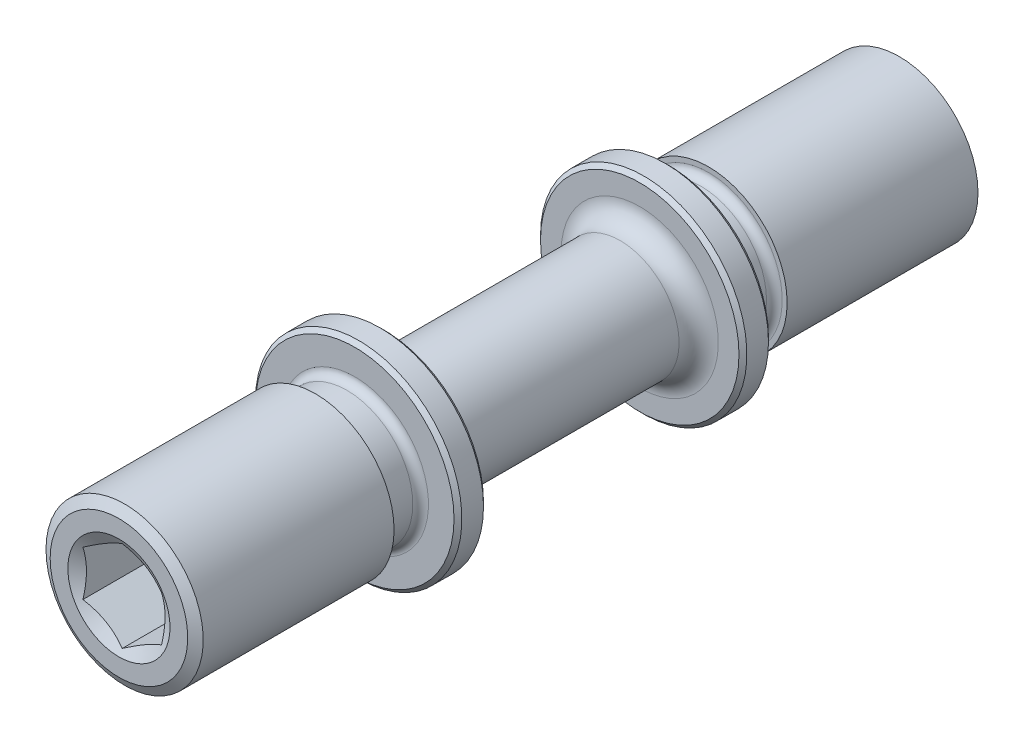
ISO-10303-21;
HEADER;
FILE_DESCRIPTION(('STEP AP214'),'2;1');
FILE_NAME('part.step','',(''),(''),'','','');
FILE_SCHEMA(('AUTOMOTIVE_DESIGN { 1 0 10303 214 1 1 1 1 }'));
ENDSEC;
DATA;
#1=APPLICATION_CONTEXT('core data for automotive mechanical design processes');
#2=APPLICATION_PROTOCOL_DEFINITION('international standard','automotive_design',2000,#1);
#3=PRODUCT_CONTEXT('',#1,'mechanical');
#4=PRODUCT('Part','Part','',(#3));
#5=PRODUCT_RELATED_PRODUCT_CATEGORY('part','',(#4));
#6=PRODUCT_DEFINITION_FORMATION('','',#4);
#7=PRODUCT_DEFINITION_CONTEXT('part definition',#1,'design');
#8=PRODUCT_DEFINITION('design','',#6,#7);
#9=PRODUCT_DEFINITION_SHAPE('','',#8);
#10=(LENGTH_UNIT() NAMED_UNIT(*) SI_UNIT(.MILLI.,.METRE.));
#11=(NAMED_UNIT(*) PLANE_ANGLE_UNIT() SI_UNIT($,.RADIAN.));
#12=(NAMED_UNIT(*) SI_UNIT($,.STERADIAN.) SOLID_ANGLE_UNIT());
#13=UNCERTAINTY_MEASURE_WITH_UNIT(LENGTH_MEASURE(1.E-05),#10,'distance_accuracy_value','');
#14=(GEOMETRIC_REPRESENTATION_CONTEXT(3) GLOBAL_UNCERTAINTY_ASSIGNED_CONTEXT((#13)) GLOBAL_UNIT_ASSIGNED_CONTEXT((#10,
#11,#12)) REPRESENTATION_CONTEXT('',''));
#15=CARTESIAN_POINT('',(0.,0.,0.));
#16=DIRECTION('',(0.,0.,1.));
#17=DIRECTION('',(1.,0.,0.));
#18=AXIS2_PLACEMENT_3D('',#15,#16,#17);
#19=CARTESIAN_POINT('',(0.,3.00000000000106,6.49999999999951));
#20=DIRECTION('',(0.,1.63071571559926E-13,1.));
#21=DIRECTION('',(1.,0.,0.));
#22=AXIS2_PLACEMENT_3D('',#19,#20,#21);
#23=PLANE('',#22);
#24=CARTESIAN_POINT('',(0.,1.05996521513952E-12,6.5));
#25=DIRECTION('',(0.,1.63071571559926E-13,1.));
#26=DIRECTION('',(1.,0.,0.));
#27=AXIS2_PLACEMENT_3D('',#24,#25,#26);
#28=CIRCLE('',#27,5.05);
#29=CARTESIAN_POINT('',(5.05,1.05996521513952E-12,6.5));
#30=VERTEX_POINT('',#29);
#31=EDGE_CURVE('E9',#30,#30,#28,.F.);
#32=ORIENTED_EDGE('',*,*,#31,.T.);
#33=EDGE_LOOP('',(#32));
#34=FACE_BOUND('',#33,.T.);
#35=CARTESIAN_POINT('',(0.,1.05996521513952E-12,6.5));
#36=DIRECTION('',(0.,1.63071571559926E-13,1.));
#37=DIRECTION('',(1.,0.,0.));
#38=AXIS2_PLACEMENT_3D('',#35,#36,#37);
#39=CIRCLE('',#38,4.);
#40=CARTESIAN_POINT('',(4.,1.05996521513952E-12,6.5));
#41=VERTEX_POINT('',#40);
#42=EDGE_CURVE('E138',#41,#41,#39,.T.);
#43=ORIENTED_EDGE('',*,*,#42,.T.);
#44=EDGE_LOOP('',(#43));
#45=FACE_BOUND('',#44,.T.);
#46=ADVANCED_FACE('F14',(#34,#45),#23,.F.);
#47=CARTESIAN_POINT('',(0.,3.26143143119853E-12,20.));
#48=DIRECTION('',(0.,-1.63071571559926E-13,-1.));
#49=DIRECTION('',(-1.,0.,0.));
#50=AXIS2_PLACEMENT_3D('',#47,#48,#49);
#51=CYLINDRICAL_SURFACE('',#50,3.);
#52=CARTESIAN_POINT('',(0.,8.96893643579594E-13,5.5));
#53=DIRECTION('',(0.,1.63071571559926E-13,1.));
#54=DIRECTION('',(1.,0.,0.));
#55=AXIS2_PLACEMENT_3D('',#52,#53,#54);
#56=CIRCLE('',#55,3.);
#57=CARTESIAN_POINT('',(3.,8.96893643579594E-13,5.5));
#58=VERTEX_POINT('',#57);
#59=EDGE_CURVE('E135',#58,#58,#56,.F.);
#60=ORIENTED_EDGE('',*,*,#59,.T.);
#61=EDGE_LOOP('',(#60));
#62=FACE_BOUND('',#61,.T.);
#63=CARTESIAN_POINT('',(0.,-8.96893643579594E-13,-5.5));
#64=DIRECTION('',(0.,-1.63071571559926E-13,-1.));
#65=DIRECTION('',(-1.,0.,0.));
#66=AXIS2_PLACEMENT_3D('',#63,#64,#65);
#67=CIRCLE('',#66,3.);
#68=CARTESIAN_POINT('',(-3.,-8.96893643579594E-13,-5.5));
#69=VERTEX_POINT('',#68);
#70=EDGE_CURVE('E132',#69,#69,#67,.F.);
#71=ORIENTED_EDGE('',*,*,#70,.T.);
#72=EDGE_LOOP('',(#71));
#73=FACE_BOUND('',#72,.T.);
#74=ADVANCED_FACE('F186',(#62,#73),#51,.T.);
#75=CARTESIAN_POINT('',(0.,3.99999999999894,-6.50000000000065));
#76=DIRECTION('',(0.,-1.63071571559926E-13,-1.));
#77=DIRECTION('',(-1.,0.,0.));
#78=AXIS2_PLACEMENT_3D('',#75,#76,#77);
#79=PLANE('',#78);
#80=CARTESIAN_POINT('',(0.,-1.05996521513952E-12,-6.5));
#81=DIRECTION('',(0.,-1.63071571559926E-13,-1.));
#82=DIRECTION('',(-1.,0.,0.));
#83=AXIS2_PLACEMENT_3D('',#80,#81,#82);
#84=CIRCLE('',#83,5.05);
#85=CARTESIAN_POINT('',(-5.05,-1.05996521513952E-12,-6.5));
#86=VERTEX_POINT('',#85);
#87=EDGE_CURVE('E153',#86,#86,#84,.F.);
#88=ORIENTED_EDGE('',*,*,#87,.T.);
#89=EDGE_LOOP('',(#88));
#90=FACE_BOUND('',#89,.T.);
#91=CARTESIAN_POINT('',(0.,-1.05996521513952E-12,-6.5));
#92=DIRECTION('',(0.,-1.63071571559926E-13,-1.));
#93=DIRECTION('',(-1.,0.,0.));
#94=AXIS2_PLACEMENT_3D('',#91,#92,#93);
#95=CIRCLE('',#94,4.);
#96=CARTESIAN_POINT('',(-4.,-1.05996521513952E-12,-6.5));
#97=VERTEX_POINT('',#96);
#98=EDGE_CURVE('E141',#97,#97,#95,.T.);
#99=ORIENTED_EDGE('',*,*,#98,.T.);
#100=EDGE_LOOP('',(#99));
#101=FACE_BOUND('',#100,.T.);
#102=ADVANCED_FACE('F176',(#90,#101),#79,.F.);
#103=CARTESIAN_POINT('',(0.,3.26143143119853E-12,20.));
#104=DIRECTION('',(0.,-1.63071571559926E-13,-1.));
#105=DIRECTION('',(-1.,0.,0.));
#106=AXIS2_PLACEMENT_3D('',#103,#104,#105);
#107=CYLINDRICAL_SURFACE('',#106,5.25);
#108=CARTESIAN_POINT('',(0.,1.27195825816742E-12,7.8));
#109=DIRECTION('',(0.,-1.63071571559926E-13,-1.));
#110=DIRECTION('',(-1.,0.,0.));
#111=AXIS2_PLACEMENT_3D('',#108,#109,#110);
#112=CIRCLE('',#111,5.25);
#113=CARTESIAN_POINT('',(-5.25,1.27195825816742E-12,7.8));
#114=VERTEX_POINT('',#113);
#115=EDGE_CURVE('E159',#114,#114,#112,.T.);
#116=ORIENTED_EDGE('',*,*,#115,.T.);
#117=EDGE_LOOP('',(#116));
#118=FACE_BOUND('',#117,.T.);
#119=CARTESIAN_POINT('',(0.,1.0925795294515E-12,6.7));
#120=DIRECTION('',(0.,1.63071571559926E-13,1.));
#121=DIRECTION('',(1.,0.,0.));
#122=AXIS2_PLACEMENT_3D('',#119,#120,#121);
#123=CIRCLE('',#122,5.25);
#124=CARTESIAN_POINT('',(5.25,1.0925795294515E-12,6.7));
#125=VERTEX_POINT('',#124);
#126=EDGE_CURVE('E156',#125,#125,#123,.T.);
#127=ORIENTED_EDGE('',*,*,#126,.T.);
#128=EDGE_LOOP('',(#127));
#129=FACE_BOUND('',#128,.T.);
#130=ADVANCED_FACE('F173',(#118,#129),#107,.T.);
#131=CARTESIAN_POINT('',(0.,4.00000000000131,7.99999999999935));
#132=DIRECTION('',(0.,-1.63071571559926E-13,-1.));
#133=DIRECTION('',(-1.,0.,0.));
#134=AXIS2_PLACEMENT_3D('',#131,#132,#133);
#135=PLANE('',#134);
#136=CARTESIAN_POINT('',(0.,1.30457257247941E-12,8.));
#137=DIRECTION('',(0.,-1.63071571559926E-13,-1.));
#138=DIRECTION('',(-1.,0.,0.));
#139=AXIS2_PLACEMENT_3D('',#136,#137,#138);
#140=CIRCLE('',#139,5.05);
#141=CARTESIAN_POINT('',(-5.05,1.30457257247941E-12,8.));
#142=VERTEX_POINT('',#141);
#143=EDGE_CURVE('E22',#142,#142,#140,.F.);
#144=ORIENTED_EDGE('',*,*,#143,.T.);
#145=EDGE_LOOP('',(#144));
#146=FACE_BOUND('',#145,.T.);
#147=CARTESIAN_POINT('',(0.,1.30457257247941E-12,8.));
#148=DIRECTION('',(0.,-1.63071571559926E-13,-1.));
#149=DIRECTION('',(-1.,0.,0.));
#150=AXIS2_PLACEMENT_3D('',#147,#148,#149);
#151=CIRCLE('',#150,3.75);
#152=CARTESIAN_POINT('',(-3.75,1.30457257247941E-12,8.));
#153=VERTEX_POINT('',#152);
#154=EDGE_CURVE('E117',#153,#153,#151,.T.);
#155=ORIENTED_EDGE('',*,*,#154,.T.);
#156=EDGE_LOOP('',(#155));
#157=FACE_BOUND('',#156,.T.);
#158=ADVANCED_FACE('F164',(#146,#157),#135,.F.);
#159=CARTESIAN_POINT('',(0.,3.26143143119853E-12,20.));
#160=DIRECTION('',(0.,-1.63071571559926E-13,-1.));
#161=DIRECTION('',(-1.,0.,0.));
#162=AXIS2_PLACEMENT_3D('',#159,#160,#161);
#163=CYLINDRICAL_SURFACE('',#162,5.25);
#164=CARTESIAN_POINT('',(0.,-1.27195825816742E-12,-7.8));
#165=DIRECTION('',(0.,1.63071571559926E-13,1.));
#166=DIRECTION('',(1.,0.,0.));
#167=AXIS2_PLACEMENT_3D('',#164,#165,#166);
#168=CIRCLE('',#167,5.25);
#169=CARTESIAN_POINT('',(5.25,-1.27195825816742E-12,-7.8));
#170=VERTEX_POINT('',#169);
#171=EDGE_CURVE('E150',#170,#170,#168,.T.);
#172=ORIENTED_EDGE('',*,*,#171,.T.);
#173=EDGE_LOOP('',(#172));
#174=FACE_BOUND('',#173,.T.);
#175=CARTESIAN_POINT('',(0.,-1.0925795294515E-12,-6.7));
#176=DIRECTION('',(0.,-1.63071571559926E-13,-1.));
#177=DIRECTION('',(-1.,0.,0.));
#178=AXIS2_PLACEMENT_3D('',#175,#176,#177);
#179=CIRCLE('',#178,5.25);
#180=CARTESIAN_POINT('',(-5.25,-1.0925795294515E-12,-6.7));
#181=VERTEX_POINT('',#180);
#182=EDGE_CURVE('E147',#181,#181,#179,.T.);
#183=ORIENTED_EDGE('',*,*,#182,.T.);
#184=EDGE_LOOP('',(#183));
#185=FACE_BOUND('',#184,.T.);
#186=ADVANCED_FACE('F266',(#174,#185),#163,.T.);
#187=CARTESIAN_POINT('',(0.,3.99999999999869,-8.00000000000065));
#188=DIRECTION('',(0.,1.63071571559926E-13,1.));
#189=DIRECTION('',(1.,0.,0.));
#190=AXIS2_PLACEMENT_3D('',#187,#188,#189);
#191=PLANE('',#190);
#192=CARTESIAN_POINT('',(0.,-1.30457257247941E-12,-8.));
#193=DIRECTION('',(0.,1.63071571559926E-13,1.));
#194=DIRECTION('',(1.,0.,0.));
#195=AXIS2_PLACEMENT_3D('',#192,#193,#194);
#196=CIRCLE('',#195,5.05);
#197=CARTESIAN_POINT('',(5.05,-1.30457257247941E-12,-8.));
#198=VERTEX_POINT('',#197);
#199=EDGE_CURVE('E144',#198,#198,#196,.F.);
#200=ORIENTED_EDGE('',*,*,#199,.T.);
#201=EDGE_LOOP('',(#200));
#202=FACE_BOUND('',#201,.T.);
#203=CARTESIAN_POINT('',(0.,-1.30457257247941E-12,-8.));
#204=DIRECTION('',(0.,1.63071571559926E-13,1.));
#205=DIRECTION('',(1.,0.,0.));
#206=AXIS2_PLACEMENT_3D('',#203,#204,#205);
#207=CIRCLE('',#206,3.75);
#208=CARTESIAN_POINT('',(3.75,-1.30457257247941E-12,-8.));
#209=VERTEX_POINT('',#208);
#210=EDGE_CURVE('E120',#209,#209,#207,.T.);
#211=ORIENTED_EDGE('',*,*,#210,.T.);
#212=EDGE_LOOP('',(#211));
#213=FACE_BOUND('',#212,.T.);
#214=ADVANCED_FACE('F268',(#202,#213),#191,.F.);
#215=CARTESIAN_POINT('',(0.,3.26143143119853E-12,20.));
#216=DIRECTION('',(0.,1.63071571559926E-13,1.));
#217=DIRECTION('',(1.,0.,0.));
#218=AXIS2_PLACEMENT_3D('',#215,#216,#217);
#219=CYLINDRICAL_SURFACE('',#218,3.35);
#220=CARTESIAN_POINT('',(0.,1.56548708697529E-12,9.6));
#221=DIRECTION('',(0.,1.63071571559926E-13,1.));
#222=DIRECTION('',(1.,0.,0.));
#223=AXIS2_PLACEMENT_3D('',#220,#221,#222);
#224=CIRCLE('',#223,3.35);
#225=CARTESIAN_POINT('',(3.35,1.56548708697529E-12,9.6));
#226=VERTEX_POINT('',#225);
#227=EDGE_CURVE('E114',#226,#226,#224,.F.);
#228=ORIENTED_EDGE('',*,*,#227,.T.);
#229=EDGE_LOOP('',(#228));
#230=FACE_BOUND('',#229,.T.);
#231=CARTESIAN_POINT('',(0.,1.36980120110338E-12,8.4));
#232=DIRECTION('',(0.,-1.63071571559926E-13,-1.));
#233=DIRECTION('',(-1.,0.,0.));
#234=AXIS2_PLACEMENT_3D('',#231,#232,#233);
#235=CIRCLE('',#234,3.35);
#236=CARTESIAN_POINT('',(-3.35,1.36980120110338E-12,8.4));
#237=VERTEX_POINT('',#236);
#238=EDGE_CURVE('E111',#237,#237,#235,.F.);
#239=ORIENTED_EDGE('',*,*,#238,.T.);
#240=EDGE_LOOP('',(#239));
#241=FACE_BOUND('',#240,.T.);
#242=ADVANCED_FACE('F276',(#230,#241),#219,.T.);
#243=CARTESIAN_POINT('',(0.,4.00000000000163,9.99999999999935));
#244=DIRECTION('',(0.,1.63071571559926E-13,1.));
#245=DIRECTION('',(1.,0.,0.));
#246=AXIS2_PLACEMENT_3D('',#243,#244,#245);
#247=PLANE('',#246);
#248=CARTESIAN_POINT('',(0.,1.63071571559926E-12,10.));
#249=DIRECTION('',(0.,1.63071571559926E-13,1.));
#250=DIRECTION('',(1.,0.,0.));
#251=AXIS2_PLACEMENT_3D('',#248,#249,#250);
#252=CIRCLE('',#251,3.75);
#253=CARTESIAN_POINT('',(3.75,1.63071571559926E-12,10.));
#254=VERTEX_POINT('',#253);
#255=EDGE_CURVE('E108',#254,#254,#252,.T.);
#256=ORIENTED_EDGE('',*,*,#255,.T.);
#257=EDGE_LOOP('',(#256));
#258=FACE_BOUND('',#257,.T.);
#259=CARTESIAN_POINT('',(0.,1.63071571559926E-12,10.));
#260=DIRECTION('',(0.,1.63071571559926E-13,1.));
#261=DIRECTION('',(1.,0.,0.));
#262=AXIS2_PLACEMENT_3D('',#259,#260,#261);
#263=CIRCLE('',#262,4.);
#264=CARTESIAN_POINT('',(4.,1.63071571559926E-12,10.));
#265=VERTEX_POINT('',#264);
#266=EDGE_CURVE('E372',#265,#265,#263,.T.);
#267=ORIENTED_EDGE('',*,*,#266,.F.);
#268=EDGE_LOOP('',(#267));
#269=FACE_BOUND('',#268,.T.);
#270=ADVANCED_FACE('F229',(#258,#269),#247,.F.);
#271=CARTESIAN_POINT('',(0.,3.26143143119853E-12,20.));
#272=DIRECTION('',(0.,-1.63071571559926E-13,-1.));
#273=DIRECTION('',(-1.,0.,0.));
#274=AXIS2_PLACEMENT_3D('',#271,#272,#273);
#275=PLANE('',#274);
#276=CARTESIAN_POINT('',(0.,3.26143143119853E-12,20.));
#277=DIRECTION('',(0.,1.63071571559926E-13,1.));
#278=DIRECTION('',(1.,0.,0.));
#279=AXIS2_PLACEMENT_3D('',#276,#277,#278);
#280=CIRCLE('',#279,2.6);
#281=CARTESIAN_POINT('',(2.6,3.26143143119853E-12,20.));
#282=VERTEX_POINT('',#281);
#283=EDGE_CURVE('E84',#282,#282,#280,.T.);
#284=ORIENTED_EDGE('',*,*,#283,.F.);
#285=EDGE_LOOP('',(#284));
#286=FACE_BOUND('',#285,.T.);
#287=CARTESIAN_POINT('',(0.,3.26143143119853E-12,20.));
#288=DIRECTION('',(0.,-1.63071571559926E-13,-1.));
#289=DIRECTION('',(-1.,0.,0.));
#290=AXIS2_PLACEMENT_3D('',#287,#288,#289);
#291=CIRCLE('',#290,3.5);
#292=CARTESIAN_POINT('',(-3.5,3.26143143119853E-12,20.));
#293=VERTEX_POINT('',#292);
#294=EDGE_CURVE('E99',#293,#293,#291,.F.);
#295=ORIENTED_EDGE('',*,*,#294,.T.);
#296=EDGE_LOOP('',(#295));
#297=FACE_BOUND('',#296,.T.);
#298=ADVANCED_FACE('F226',(#286,#297),#275,.F.);
#299=CARTESIAN_POINT('',(0.,3.21435672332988E-12,19.7113248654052));
#300=DIRECTION('',(0.,-1.63071571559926E-13,-1.));
#301=DIRECTION('',(-1.,0.,0.));
#302=AXIS2_PLACEMENT_3D('',#299,#300,#301);
#303=CONICAL_SURFACE('',#302,4.,1.0471975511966);
#304=ORIENTED_EDGE('',*,*,#294,.F.);
#305=EDGE_LOOP('',(#304));
#306=FACE_BOUND('',#305,.T.);
#307=CARTESIAN_POINT('',(0.,3.21435672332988E-12,19.7113248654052));
#308=DIRECTION('',(0.,-1.63071571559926E-13,-1.));
#309=DIRECTION('',(-1.,0.,0.));
#310=AXIS2_PLACEMENT_3D('',#307,#308,#309);
#311=CIRCLE('',#310,4.);
#312=CARTESIAN_POINT('',(-4.,3.21435672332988E-12,19.7113248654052));
#313=VERTEX_POINT('',#312);
#314=EDGE_CURVE('E96',#313,#313,#311,.T.);
#315=ORIENTED_EDGE('',*,*,#314,.F.);
#316=EDGE_LOOP('',(#315));
#317=FACE_BOUND('',#316,.T.);
#318=ADVANCED_FACE('F224',(#306,#317),#303,.T.);
#319=CARTESIAN_POINT('',(0.,3.26143143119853E-12,20.));
#320=DIRECTION('',(0.,-1.63071571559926E-13,-1.));
#321=DIRECTION('',(-1.,0.,0.));
#322=AXIS2_PLACEMENT_3D('',#319,#320,#321);
#323=CYLINDRICAL_SURFACE('',#322,4.);
#324=ORIENTED_EDGE('',*,*,#266,.T.);
#325=EDGE_LOOP('',(#324));
#326=FACE_BOUND('',#325,.T.);
#327=ORIENTED_EDGE('',*,*,#314,.T.);
#328=EDGE_LOOP('',(#327));
#329=FACE_BOUND('',#328,.T.);
#330=ADVANCED_FACE('F220',(#326,#329),#323,.T.);
#331=CARTESIAN_POINT('',(0.,3.26143143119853E-12,20.));
#332=DIRECTION('',(0.,1.63071571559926E-13,1.));
#333=DIRECTION('',(1.,0.,0.));
#334=AXIS2_PLACEMENT_3D('',#331,#332,#333);
#335=CYLINDRICAL_SURFACE('',#334,3.35);
#336=CARTESIAN_POINT('',(0.,-1.36980120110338E-12,-8.4));
#337=DIRECTION('',(0.,1.63071571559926E-13,1.));
#338=DIRECTION('',(1.,0.,0.));
#339=AXIS2_PLACEMENT_3D('',#336,#337,#338);
#340=CIRCLE('',#339,3.35);
#341=CARTESIAN_POINT('',(3.35,-1.36980120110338E-12,-8.4));
#342=VERTEX_POINT('',#341);
#343=EDGE_CURVE('E126',#342,#342,#340,.F.);
#344=ORIENTED_EDGE('',*,*,#343,.T.);
#345=EDGE_LOOP('',(#344));
#346=FACE_BOUND('',#345,.T.);
#347=CARTESIAN_POINT('',(0.,-1.56548708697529E-12,-9.6));
#348=DIRECTION('',(0.,-1.63071571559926E-13,-1.));
#349=DIRECTION('',(-1.,0.,0.));
#350=AXIS2_PLACEMENT_3D('',#347,#348,#349);
#351=CIRCLE('',#350,3.35);
#352=CARTESIAN_POINT('',(-3.35,-1.56548708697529E-12,-9.6));
#353=VERTEX_POINT('',#352);
#354=EDGE_CURVE('E123',#353,#353,#351,.F.);
#355=ORIENTED_EDGE('',*,*,#354,.T.);
#356=EDGE_LOOP('',(#355));
#357=FACE_BOUND('',#356,.T.);
#358=ADVANCED_FACE('F223',(#346,#357),#335,.T.);
#359=CARTESIAN_POINT('',(0.,3.99999999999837,-10.0000000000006));
#360=DIRECTION('',(0.,-1.63071571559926E-13,-1.));
#361=DIRECTION('',(-1.,0.,0.));
#362=AXIS2_PLACEMENT_3D('',#359,#360,#361);
#363=PLANE('',#362);
#364=CARTESIAN_POINT('',(0.,-1.63071571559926E-12,-10.));
#365=DIRECTION('',(0.,-1.63071571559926E-13,-1.));
#366=DIRECTION('',(-1.,0.,0.));
#367=AXIS2_PLACEMENT_3D('',#364,#365,#366);
#368=CIRCLE('',#367,3.75);
#369=CARTESIAN_POINT('',(-3.75,-1.63071571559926E-12,-10.));
#370=VERTEX_POINT('',#369);
#371=EDGE_CURVE('E129',#370,#370,#368,.T.);
#372=ORIENTED_EDGE('',*,*,#371,.T.);
#373=EDGE_LOOP('',(#372));
#374=FACE_BOUND('',#373,.T.);
#375=CARTESIAN_POINT('',(0.,-1.63071571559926E-12,-10.));
#376=DIRECTION('',(0.,1.63071571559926E-13,1.));
#377=DIRECTION('',(1.,0.,0.));
#378=AXIS2_PLACEMENT_3D('',#375,#376,#377);
#379=CIRCLE('',#378,4.);
#380=CARTESIAN_POINT('',(4.,-1.63071571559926E-12,-10.));
#381=VERTEX_POINT('',#380);
#382=EDGE_CURVE('E370',#381,#381,#379,.T.);
#383=ORIENTED_EDGE('',*,*,#382,.T.);
#384=EDGE_LOOP('',(#383));
#385=FACE_BOUND('',#384,.T.);
#386=ADVANCED_FACE('F315',(#374,#385),#363,.F.);
#387=CARTESIAN_POINT('',(0.,-3.26633001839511E-12,-20.));
#388=DIRECTION('',(0.,1.63071571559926E-13,1.));
#389=DIRECTION('',(1.,0.,0.));
#390=AXIS2_PLACEMENT_3D('',#387,#388,#389);
#391=PLANE('',#390);
#392=CARTESIAN_POINT('',(0.,-3.26143143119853E-12,-20.));
#393=DIRECTION('',(0.,1.63071571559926E-13,1.));
#394=DIRECTION('',(1.,0.,0.));
#395=AXIS2_PLACEMENT_3D('',#392,#393,#394);
#396=CIRCLE('',#395,3.5);
#397=CARTESIAN_POINT('',(3.5,-3.26143143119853E-12,-20.));
#398=VERTEX_POINT('',#397);
#399=EDGE_CURVE('E102',#398,#398,#396,.F.);
#400=ORIENTED_EDGE('',*,*,#399,.T.);
#401=EDGE_LOOP('',(#400));
#402=FACE_BOUND('',#401,.T.);
#403=ADVANCED_FACE('F237',(#402),#391,.F.);
#404=CARTESIAN_POINT('',(0.,-3.26143143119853E-12,-20.));
#405=DIRECTION('',(0.,1.63071571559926E-13,1.));
#406=DIRECTION('',(1.,0.,0.));
#407=AXIS2_PLACEMENT_3D('',#404,#405,#406);
#408=CONICAL_SURFACE('',#407,3.5,1.0471975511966);
#409=CARTESIAN_POINT('',(0.,-3.21435672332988E-12,-19.7113248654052));
#410=DIRECTION('',(0.,1.63071571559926E-13,1.));
#411=DIRECTION('',(1.,0.,0.));
#412=AXIS2_PLACEMENT_3D('',#409,#410,#411);
#413=CIRCLE('',#412,4.);
#414=CARTESIAN_POINT('',(4.,-3.21435672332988E-12,-19.7113248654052));
#415=VERTEX_POINT('',#414);
#416=EDGE_CURVE('E105',#415,#415,#413,.T.);
#417=ORIENTED_EDGE('',*,*,#416,.F.);
#418=EDGE_LOOP('',(#417));
#419=FACE_BOUND('',#418,.T.);
#420=ORIENTED_EDGE('',*,*,#399,.F.);
#421=EDGE_LOOP('',(#420));
#422=FACE_BOUND('',#421,.T.);
#423=ADVANCED_FACE('F234',(#419,#422),#408,.T.);
#424=CARTESIAN_POINT('',(0.,3.26143143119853E-12,20.));
#425=DIRECTION('',(0.,-1.63071571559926E-13,-1.));
#426=DIRECTION('',(-1.,0.,0.));
#427=AXIS2_PLACEMENT_3D('',#424,#425,#426);
#428=CYLINDRICAL_SURFACE('',#427,4.);
#429=ORIENTED_EDGE('',*,*,#382,.F.);
#430=EDGE_LOOP('',(#429));
#431=FACE_BOUND('',#430,.T.);
#432=ORIENTED_EDGE('',*,*,#416,.T.);
#433=EDGE_LOOP('',(#432));
#434=FACE_BOUND('',#433,.T.);
#435=ADVANCED_FACE('F217',(#431,#434),#428,.T.);
#436=CARTESIAN_POINT('',(0.,1.56548708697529E-12,9.6));
#437=DIRECTION('',(0.,1.63071571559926E-13,1.));
#438=DIRECTION('',(1.,0.,0.));
#439=AXIS2_PLACEMENT_3D('',#436,#437,#438);
#440=TOROIDAL_SURFACE('',#439,3.75,0.4);
#441=ORIENTED_EDGE('',*,*,#227,.F.);
#442=EDGE_LOOP('',(#441));
#443=FACE_BOUND('',#442,.T.);
#444=ORIENTED_EDGE('',*,*,#255,.F.);
#445=EDGE_LOOP('',(#444));
#446=FACE_BOUND('',#445,.T.);
#447=ADVANCED_FACE('F239',(#443,#446),#440,.F.);
#448=CARTESIAN_POINT('',(0.,1.36980120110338E-12,8.4));
#449=DIRECTION('',(0.,-1.63071571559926E-13,-1.));
#450=DIRECTION('',(-1.,0.,0.));
#451=AXIS2_PLACEMENT_3D('',#448,#449,#450);
#452=TOROIDAL_SURFACE('',#451,3.75,0.4);
#453=ORIENTED_EDGE('',*,*,#154,.F.);
#454=EDGE_LOOP('',(#453));
#455=FACE_BOUND('',#454,.T.);
#456=ORIENTED_EDGE('',*,*,#238,.F.);
#457=EDGE_LOOP('',(#456));
#458=FACE_BOUND('',#457,.T.);
#459=ADVANCED_FACE('F242',(#455,#458),#452,.F.);
#460=CARTESIAN_POINT('',(0.,-1.36980120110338E-12,-8.4));
#461=DIRECTION('',(0.,1.63071571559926E-13,1.));
#462=DIRECTION('',(1.,0.,0.));
#463=AXIS2_PLACEMENT_3D('',#460,#461,#462);
#464=TOROIDAL_SURFACE('',#463,3.75,0.4);
#465=ORIENTED_EDGE('',*,*,#343,.F.);
#466=EDGE_LOOP('',(#465));
#467=FACE_BOUND('',#466,.T.);
#468=ORIENTED_EDGE('',*,*,#210,.F.);
#469=EDGE_LOOP('',(#468));
#470=FACE_BOUND('',#469,.T.);
#471=ADVANCED_FACE('F246',(#467,#470),#464,.F.);
#472=CARTESIAN_POINT('',(0.,-1.56548708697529E-12,-9.6));
#473=DIRECTION('',(0.,-1.63071571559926E-13,-1.));
#474=DIRECTION('',(-1.,0.,0.));
#475=AXIS2_PLACEMENT_3D('',#472,#473,#474);
#476=TOROIDAL_SURFACE('',#475,3.75,0.4);
#477=ORIENTED_EDGE('',*,*,#371,.F.);
#478=EDGE_LOOP('',(#477));
#479=FACE_BOUND('',#478,.T.);
#480=ORIENTED_EDGE('',*,*,#354,.F.);
#481=EDGE_LOOP('',(#480));
#482=FACE_BOUND('',#481,.T.);
#483=ADVANCED_FACE('F194',(#479,#482),#476,.F.);
#484=CARTESIAN_POINT('',(0.,8.96893643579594E-13,5.5));
#485=DIRECTION('',(0.,1.63071571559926E-13,1.));
#486=DIRECTION('',(1.,0.,0.));
#487=AXIS2_PLACEMENT_3D('',#484,#485,#486);
#488=TOROIDAL_SURFACE('',#487,4.,1.);
#489=ORIENTED_EDGE('',*,*,#42,.F.);
#490=EDGE_LOOP('',(#489));
#491=FACE_BOUND('',#490,.T.);
#492=ORIENTED_EDGE('',*,*,#59,.F.);
#493=EDGE_LOOP('',(#492));
#494=FACE_BOUND('',#493,.T.);
#495=ADVANCED_FACE('F190',(#491,#494),#488,.F.);
#496=CARTESIAN_POINT('',(0.,-8.96893643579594E-13,-5.5));
#497=DIRECTION('',(0.,-1.63071571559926E-13,-1.));
#498=DIRECTION('',(-1.,0.,0.));
#499=AXIS2_PLACEMENT_3D('',#496,#497,#498);
#500=TOROIDAL_SURFACE('',#499,4.,1.);
#501=ORIENTED_EDGE('',*,*,#70,.F.);
#502=EDGE_LOOP('',(#501));
#503=FACE_BOUND('',#502,.T.);
#504=ORIENTED_EDGE('',*,*,#98,.F.);
#505=EDGE_LOOP('',(#504));
#506=FACE_BOUND('',#505,.T.);
#507=ADVANCED_FACE('F193',(#503,#506),#500,.F.);
#508=CARTESIAN_POINT('',(0.,-1.30457257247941E-12,-8.));
#509=DIRECTION('',(0.,1.63071571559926E-13,1.));
#510=DIRECTION('',(1.,0.,0.));
#511=AXIS2_PLACEMENT_3D('',#508,#509,#510);
#512=CONICAL_SURFACE('',#511,5.05,0.785398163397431);
#513=ORIENTED_EDGE('',*,*,#171,.F.);
#514=EDGE_LOOP('',(#513));
#515=FACE_BOUND('',#514,.T.);
#516=ORIENTED_EDGE('',*,*,#199,.F.);
#517=EDGE_LOOP('',(#516));
#518=FACE_BOUND('',#517,.T.);
#519=ADVANCED_FACE('F205',(#515,#518),#512,.T.);
#520=CARTESIAN_POINT('',(0.,-1.0925795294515E-12,-6.7));
#521=DIRECTION('',(0.,-1.63071571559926E-13,-1.));
#522=DIRECTION('',(-1.,0.,0.));
#523=AXIS2_PLACEMENT_3D('',#520,#521,#522);
#524=CONICAL_SURFACE('',#523,5.25,0.785398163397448);
#525=ORIENTED_EDGE('',*,*,#87,.F.);
#526=EDGE_LOOP('',(#525));
#527=FACE_BOUND('',#526,.T.);
#528=ORIENTED_EDGE('',*,*,#182,.F.);
#529=EDGE_LOOP('',(#528));
#530=FACE_BOUND('',#529,.T.);
#531=ADVANCED_FACE('F170',(#527,#530),#524,.T.);
#532=CARTESIAN_POINT('',(0.,1.27195825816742E-12,7.8));
#533=DIRECTION('',(0.,-1.63071571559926E-13,-1.));
#534=DIRECTION('',(-1.,0.,0.));
#535=AXIS2_PLACEMENT_3D('',#532,#533,#534);
#536=CONICAL_SURFACE('',#535,5.25,0.785398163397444);
#537=ORIENTED_EDGE('',*,*,#143,.F.);
#538=EDGE_LOOP('',(#537));
#539=FACE_BOUND('',#538,.T.);
#540=ORIENTED_EDGE('',*,*,#115,.F.);
#541=EDGE_LOOP('',(#540));
#542=FACE_BOUND('',#541,.T.);
#543=ADVANCED_FACE('F167',(#539,#542),#536,.T.);
#544=CARTESIAN_POINT('',(0.,1.05996521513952E-12,6.5));
#545=DIRECTION('',(0.,1.63071571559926E-13,1.));
#546=DIRECTION('',(1.,0.,0.));
#547=AXIS2_PLACEMENT_3D('',#544,#545,#546);
#548=CONICAL_SURFACE('',#547,5.05,0.785398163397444);
#549=ORIENTED_EDGE('',*,*,#126,.F.);
#550=EDGE_LOOP('',(#549));
#551=FACE_BOUND('',#550,.T.);
#552=ORIENTED_EDGE('',*,*,#31,.F.);
#553=EDGE_LOOP('',(#552));
#554=FACE_BOUND('',#553,.T.);
#555=ADVANCED_FACE('F16',(#551,#554),#548,.T.);
#556=CARTESIAN_POINT('',(0.,3.26143143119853E-12,20.));
#557=DIRECTION('',(0.,1.63071571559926E-13,1.));
#558=DIRECTION('',(1.,0.,0.));
#559=AXIS2_PLACEMENT_3D('',#556,#557,#558);
#560=CONICAL_SURFACE('',#559,2.6,1.0471975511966);
#561=ORIENTED_EDGE('',*,*,#283,.T.);
#562=EDGE_LOOP('',(#561));
#563=FACE_BOUND('',#562,.T.);
#564=CARTESIAN_POINT('',(0.000200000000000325,2.30951654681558,19.8322893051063));
#565=CARTESIAN_POINT('',(-0.0876912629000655,2.2587725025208,19.8029793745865));
#566=CARTESIAN_POINT('',(-0.176341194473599,2.20759044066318,19.7763226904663));
#567=CARTESIAN_POINT('',(-0.355176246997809,2.10433997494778,19.7297923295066));
#568=CARTESIAN_POINT('',(-0.445364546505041,2.05226973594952,19.7099351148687));
#569=CARTESIAN_POINT('',(-0.624623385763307,1.94877459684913,19.6790233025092));
#570=CARTESIAN_POINT('',(-0.713666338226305,1.89736562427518,19.6677629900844));
#571=CARTESIAN_POINT('',(-0.892171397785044,1.79430568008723,19.6543185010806));
#572=CARTESIAN_POINT('',(-0.981632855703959,1.74265508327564,19.6521231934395));
#573=CARTESIAN_POINT('',(-1.1488083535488,1.64613626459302,19.6566808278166));
#574=CARTESIAN_POINT('',(-1.22654737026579,1.60125362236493,19.662314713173));
#575=CARTESIAN_POINT('',(-1.38151891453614,1.51178075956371,19.6801737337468));
#576=CARTESIAN_POINT('',(-1.45875090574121,1.46719084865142,19.6924049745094));
#577=CARTESIAN_POINT('',(-1.61404218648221,1.37753338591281,19.7229832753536));
#578=CARTESIAN_POINT('',(-1.69208181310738,1.3324771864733,19.7414600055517));
#579=CARTESIAN_POINT('',(-1.84699686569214,1.24303693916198,19.7833953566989));
#580=CARTESIAN_POINT('',(-1.92387427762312,1.19865174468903,19.8068441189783));
#581=CARTESIAN_POINT('',(-2.0002,1.15458506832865,19.8322893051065));
#582=B_SPLINE_CURVE_WITH_KNOTS('',3,(#564,#565,#566,#567,#568,#569,#570,#571,#572,#573,#574,
#575,#576,#577,#578,#579,#580,#581),.UNSPECIFIED.,.F.,.F.,(4,2,2,2,2,2,2,2,4),(0.,
0.317031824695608,0.634825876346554,0.944753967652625,1.2543013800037,1.52387047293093,
1.79368946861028,2.06949491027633,2.34475850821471),.UNSPECIFIED.);
#583=CARTESIAN_POINT('',(0.,2.30940107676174,19.8322226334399));
#584=VERTEX_POINT('',#583);
#585=CARTESIAN_POINT('',(-2.,1.15470053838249,19.8322226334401));
#586=VERTEX_POINT('',#585);
#587=EDGE_CURVE('E29',#584,#586,#582,.T.);
#588=ORIENTED_EDGE('',*,*,#587,.F.);
#589=CARTESIAN_POINT('',(2.0002,1.15458506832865,19.8322893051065));
#590=CARTESIAN_POINT('',(1.91230873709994,1.20532911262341,19.8029793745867));
#591=CARTESIAN_POINT('',(1.8236588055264,1.25651117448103,19.7763226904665));
#592=CARTESIAN_POINT('',(1.64482375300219,1.35976164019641,19.7297923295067));
#593=CARTESIAN_POINT('',(1.55463545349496,1.41183187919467,19.7099351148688));
#594=CARTESIAN_POINT('',(1.37537661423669,1.51532701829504,19.6790233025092));
#595=CARTESIAN_POINT('',(1.28633366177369,1.56673599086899,19.6677629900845));
#596=CARTESIAN_POINT('',(1.10782860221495,1.66979593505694,19.6543185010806));
#597=CARTESIAN_POINT('',(1.01836714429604,1.72144653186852,19.6521231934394));
#598=CARTESIAN_POINT('',(0.8511916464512,1.81796535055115,19.6566808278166));
#599=CARTESIAN_POINT('',(0.773452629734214,1.86284799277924,19.6623147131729));
#600=CARTESIAN_POINT('',(0.618481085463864,1.95232085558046,19.6801737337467));
#601=CARTESIAN_POINT('',(0.5412490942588,1.99691076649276,19.6924049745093));
#602=CARTESIAN_POINT('',(0.385957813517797,2.08656822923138,19.7229832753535));
#603=CARTESIAN_POINT('',(0.307918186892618,2.13162442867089,19.7414600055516));
#604=CARTESIAN_POINT('',(0.153003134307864,2.22106467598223,19.7833953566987));
#605=CARTESIAN_POINT('',(0.0761257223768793,2.26544987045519,19.8068441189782));
#606=CARTESIAN_POINT('',(-0.00019999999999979,2.30951654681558,19.8322893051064));
#607=B_SPLINE_CURVE_WITH_KNOTS('',3,(#589,#590,#591,#592,#593,#594,#595,#596,#597,#598,#599,
#600,#601,#602,#603,#604,#605,#606),.UNSPECIFIED.,.F.,.F.,(4,2,2,2,2,2,2,2,4),(0.,
0.317031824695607,0.634825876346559,0.944753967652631,1.25430138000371,1.52387047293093,
1.79368946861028,2.06949491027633,2.34475850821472),.UNSPECIFIED.);
#608=CARTESIAN_POINT('',(2.,1.15470053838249,19.8322226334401));
#609=VERTEX_POINT('',#608);
#610=EDGE_CURVE('E70',#609,#584,#607,.T.);
#611=ORIENTED_EDGE('',*,*,#610,.F.);
#612=CARTESIAN_POINT('',(2.,-3.06090414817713,20.6099028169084));
#613=CARTESIAN_POINT('',(2.,-2.97387728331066,20.5678525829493));
#614=CARTESIAN_POINT('',(2.,-2.88664618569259,20.5262175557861));
#615=CARTESIAN_POINT('',(2.,-2.711666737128,20.4440123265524));
#616=CARTESIAN_POINT('',(2.,-2.62391830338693,20.4034423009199));
#617=CARTESIAN_POINT('',(2.,-2.44732345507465,20.3233885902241));
#618=CARTESIAN_POINT('',(2.,-2.3584736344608,20.2839123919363));
#619=CARTESIAN_POINT('',(2.,-2.18005278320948,20.2066312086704));
#620=CARTESIAN_POINT('',(2.,-2.09048178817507,20.1688261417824));
#621=CARTESIAN_POINT('',(2.,-1.90776176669,20.0942216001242));
#622=CARTESIAN_POINT('',(2.,-1.81458622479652,20.0574867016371));
#623=CARTESIAN_POINT('',(2.,-1.62713012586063,19.9868971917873));
#624=CARTESIAN_POINT('',(2.,-1.53284944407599,19.9530429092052));
#625=CARTESIAN_POINT('',(2.,-1.34322309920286,19.8891332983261));
#626=CARTESIAN_POINT('',(2.,-1.24788017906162,19.8590699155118));
#627=CARTESIAN_POINT('',(2.,-1.05582781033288,19.8037334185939));
#628=CARTESIAN_POINT('',(2.,-0.959118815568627,19.7784587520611));
#629=CARTESIAN_POINT('',(2.,-0.764799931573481,19.7340693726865));
#630=CARTESIAN_POINT('',(2.,-0.667197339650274,19.7149233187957));
#631=CARTESIAN_POINT('',(2.,-0.470823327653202,19.6839030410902));
#632=CARTESIAN_POINT('',(2.,-0.372052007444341,19.6720282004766));
#633=CARTESIAN_POINT('',(2.,-0.175103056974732,19.6566569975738));
#634=CARTESIAN_POINT('',(2.,-0.0769338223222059,19.6530561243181));
#635=CARTESIAN_POINT('',(2.,0.119349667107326,19.6542533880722));
#636=CARTESIAN_POINT('',(2.,0.217463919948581,19.6590518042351));
#637=CARTESIAN_POINT('',(2.,0.455324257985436,19.6804444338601));
#638=CARTESIAN_POINT('',(2.,0.594693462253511,19.7012480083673));
#639=CARTESIAN_POINT('',(2.,0.870817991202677,19.7560511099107));
#640=CARTESIAN_POINT('',(2.,1.00757051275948,19.7900640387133));
#641=CARTESIAN_POINT('',(2.,1.28124938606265,19.8684594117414));
#642=CARTESIAN_POINT('',(2.,1.41811354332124,19.9130532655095));
#643=CARTESIAN_POINT('',(2.,1.68931445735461,20.0091118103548));
#644=CARTESIAN_POINT('',(2.,1.82365197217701,20.0605744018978));
#645=CARTESIAN_POINT('',(2.,2.0468874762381,20.1507216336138));
#646=CARTESIAN_POINT('',(2.,2.13631980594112,20.1881016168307));
#647=CARTESIAN_POINT('',(2.,2.3144434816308,20.2645910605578));
#648=CARTESIAN_POINT('',(2.,2.40313480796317,20.3037005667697));
#649=CARTESIAN_POINT('',(2.,2.66832084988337,20.4230871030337));
#650=CARTESIAN_POINT('',(2.,2.84389342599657,20.5054080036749));
#651=CARTESIAN_POINT('',(2.,3.19348246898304,20.6736745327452));
#652=CARTESIAN_POINT('',(2.,3.36749728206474,20.7596235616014));
#653=CARTESIAN_POINT('',(2.,3.71430247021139,20.933964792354));
#654=CARTESIAN_POINT('',(2.,3.88709280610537,21.0223570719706));
#655=CARTESIAN_POINT('',(2.,4.21760639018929,21.193534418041));
#656=CARTESIAN_POINT('',(2.,4.37540052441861,21.2761830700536));
#657=CARTESIAN_POINT('',(2.,4.69041390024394,21.4425800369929));
#658=CARTESIAN_POINT('',(2.,4.84763312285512,21.5263283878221));
#659=CARTESIAN_POINT('',(2.,5.16125571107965,21.6944681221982));
#660=CARTESIAN_POINT('',(2.,5.31766012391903,21.7788575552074));
#661=CARTESIAN_POINT('',(2.,5.63010086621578,21.9482962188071));
#662=CARTESIAN_POINT('',(2.,5.78613721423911,22.0333454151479));
#663=CARTESIAN_POINT('',(2.,5.94203771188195,22.1186412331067));
#664=B_SPLINE_CURVE_WITH_KNOTS('',3,(#612,#613,#614,#615,#616,#617,#618,#619,#620,#621,#622,
#623,#624,#625,#626,#627,#628,#629,#630,#631,#632,#633,#634,#635,#636,#637,#638,#639,#640,#641,
#642,#643,#644,#645,#646,#647,#648,#649,#650,#651,#652,#653,#654,#655,#656,#657,#658,#659,#660,
#661,#662,#663),.UNSPECIFIED.,.F.,.F.,(4,2,2,2,2,2,2,2,2,2,2,2,2,2,2,2,2,2,2,2,2,2,2,2,2,4),(0.,
0.289964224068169,0.579976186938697,0.871636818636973,1.16328313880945,1.46371300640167,
1.76417711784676,2.06399167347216,2.36370886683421,2.66186790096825,2.96000163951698,
3.25434835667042,3.54870485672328,3.97057286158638,4.39287000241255,4.82444542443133,
5.25588922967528,5.54666095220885,5.83744036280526,6.41911016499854,7.00133779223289,
7.58358396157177,8.11796461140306,8.65236275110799,9.18551697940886,9.7186437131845),.UNSPECIFIED.);
#665=CARTESIAN_POINT('',(2.,-1.15470053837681,19.83222263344));
#666=VERTEX_POINT('',#665);
#667=EDGE_CURVE('E78',#666,#609,#664,.T.);
#668=ORIENTED_EDGE('',*,*,#667,.F.);
#669=CARTESIAN_POINT('',(-0.000200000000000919,-2.30951654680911,19.8322893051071));
#670=CARTESIAN_POINT('',(0.0876912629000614,-2.25877250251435,19.8029793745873));
#671=CARTESIAN_POINT('',(0.176341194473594,-2.20759044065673,19.7763226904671));
#672=CARTESIAN_POINT('',(0.355176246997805,-2.10433997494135,19.7297923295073));
#673=CARTESIAN_POINT('',(0.445364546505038,-2.05226973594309,19.7099351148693));
#674=CARTESIAN_POINT('',(0.624623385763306,-1.94877459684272,19.6790233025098));
#675=CARTESIAN_POINT('',(0.713666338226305,-1.89736562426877,19.6677629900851));
#676=CARTESIAN_POINT('',(0.892171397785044,-1.79430568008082,19.6543185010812));
#677=CARTESIAN_POINT('',(0.981632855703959,-1.74265508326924,19.65212319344));
#678=CARTESIAN_POINT('',(1.1488083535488,-1.64613626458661,19.6566808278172));
#679=CARTESIAN_POINT('',(1.22654737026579,-1.60125362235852,19.6623147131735));
#680=CARTESIAN_POINT('',(1.38151891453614,-1.5117807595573,19.6801737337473));
#681=CARTESIAN_POINT('',(1.45875090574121,-1.467190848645,19.6924049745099));
#682=CARTESIAN_POINT('',(1.61404218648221,-1.37753338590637,19.7229832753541));
#683=CARTESIAN_POINT('',(1.69208181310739,-1.33247718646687,19.7414600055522));
#684=CARTESIAN_POINT('',(1.84699686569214,-1.24303693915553,19.7833953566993));
#685=CARTESIAN_POINT('',(1.92387427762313,-1.19865174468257,19.8068441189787));
#686=CARTESIAN_POINT('',(2.0002,-1.15458506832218,19.832289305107));
#687=B_SPLINE_CURVE_WITH_KNOTS('',3,(#669,#670,#671,#672,#673,#674,#675,#676,#677,#678,#679,
#680,#681,#682,#683,#684,#685,#686),.UNSPECIFIED.,.F.,.F.,(4,2,2,2,2,2,2,2,4),(0.,
0.317031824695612,0.634825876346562,0.944753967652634,1.25430138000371,1.52387047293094,
1.79368946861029,2.06949491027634,2.34475850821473),.UNSPECIFIED.);
#688=CARTESIAN_POINT('',(0.,-2.30940107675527,19.8322226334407));
#689=VERTEX_POINT('',#688);
#690=EDGE_CURVE('E300',#689,#666,#687,.T.);
#691=ORIENTED_EDGE('',*,*,#690,.F.);
#692=CARTESIAN_POINT('',(-2.0002,-1.15458506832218,19.8322893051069));
#693=CARTESIAN_POINT('',(-1.91230873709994,-1.20532911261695,19.8029793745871));
#694=CARTESIAN_POINT('',(-1.82365880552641,-1.25651117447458,19.7763226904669));
#695=CARTESIAN_POINT('',(-1.6448237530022,-1.35976164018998,19.7297923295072));
#696=CARTESIAN_POINT('',(-1.55463545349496,-1.41183187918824,19.7099351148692));
#697=CARTESIAN_POINT('',(-1.37537661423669,-1.51532701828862,19.6790233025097));
#698=CARTESIAN_POINT('',(-1.2863336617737,-1.56673599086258,19.667762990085));
#699=CARTESIAN_POINT('',(-1.10782860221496,-1.66979593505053,19.6543185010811));
#700=CARTESIAN_POINT('',(-1.01836714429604,-1.72144653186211,19.65212319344));
#701=CARTESIAN_POINT('',(-0.851191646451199,-1.81796535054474,19.6566808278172));
#702=CARTESIAN_POINT('',(-0.773452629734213,-1.86284799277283,19.6623147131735));
#703=CARTESIAN_POINT('',(-0.618481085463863,-1.95232085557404,19.6801737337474));
#704=CARTESIAN_POINT('',(-0.541249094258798,-1.99691076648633,19.69240497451));
#705=CARTESIAN_POINT('',(-0.385957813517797,-2.08656822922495,19.7229832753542));
#706=CARTESIAN_POINT('',(-0.307918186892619,-2.13162442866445,19.7414600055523));
#707=CARTESIAN_POINT('',(-0.153003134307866,-2.22106467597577,19.7833953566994));
#708=CARTESIAN_POINT('',(-0.0761257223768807,-2.26544987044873,19.8068441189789));
#709=CARTESIAN_POINT('',(0.000199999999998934,-2.30951654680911,19.8322893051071));
#710=B_SPLINE_CURVE_WITH_KNOTS('',3,(#692,#693,#694,#695,#696,#697,#698,#699,#700,#701,#702,
#703,#704,#705,#706,#707,#708,#709),.UNSPECIFIED.,.F.,.F.,(4,2,2,2,2,2,2,2,4),(0.,
0.31703182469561,0.634825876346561,0.944753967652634,1.25430138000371,1.52387047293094,
1.79368946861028,2.06949491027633,2.34475850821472),.UNSPECIFIED.);
#711=CARTESIAN_POINT('',(-2.,-1.15470053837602,19.8322226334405));
#712=VERTEX_POINT('',#711);
#713=EDGE_CURVE('E329',#712,#689,#710,.T.);
#714=ORIENTED_EDGE('',*,*,#713,.F.);
#715=CARTESIAN_POINT('',(-2.,-3.06090277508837,20.6099021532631));
#716=CARTESIAN_POINT('',(-2.,-2.97387595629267,20.5678519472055));
#717=CARTESIAN_POINT('',(-2.,-2.8866449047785,20.5262169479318));
#718=CARTESIAN_POINT('',(-2.,-2.71166554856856,20.4440117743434));
#719=CARTESIAN_POINT('',(-2.,-2.62391716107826,20.4034417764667));
#720=CARTESIAN_POINT('',(-2.,-2.44732240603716,20.32338812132));
#721=CARTESIAN_POINT('',(-2.,-2.35847263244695,20.2839119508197));
#722=CARTESIAN_POINT('',(-2.,-2.18005187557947,20.2066308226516));
#723=CARTESIAN_POINT('',(-2.,-2.09048092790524,20.1688257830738));
#724=CARTESIAN_POINT('',(-2.,-1.90776100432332,20.0942212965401));
#725=CARTESIAN_POINT('',(-2.,-1.8145855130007,20.0574864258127));
#726=CARTESIAN_POINT('',(-2.,-1.62712951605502,19.9868969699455));
#727=CARTESIAN_POINT('',(-2.,-1.53284888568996,19.9530427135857));
#728=CARTESIAN_POINT('',(-2.,-1.34322264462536,19.8891331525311));
#729=CARTESIAN_POINT('',(-2.,-1.2478797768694,19.8590697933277));
#730=CARTESIAN_POINT('',(-2.,-1.05582751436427,19.8037333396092));
#731=CARTESIAN_POINT('',(-2.,-0.959118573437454,19.7784586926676));
#732=CARTESIAN_POINT('',(-2.,-0.764799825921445,19.734069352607));
#733=CARTESIAN_POINT('',(-2.,-0.667197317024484,19.7149233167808));
#734=CARTESIAN_POINT('',(-2.,-0.470823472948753,19.6839030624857));
#735=CARTESIAN_POINT('',(-2.,-0.372052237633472,19.6720282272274));
#736=CARTESIAN_POINT('',(-2.,-0.175103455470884,19.6566570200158));
#737=CARTESIAN_POINT('',(-2.,-0.0769343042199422,19.6530561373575));
#738=CARTESIAN_POINT('',(-2.,0.11934901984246,19.6542533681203));
#739=CARTESIAN_POINT('',(-2.,0.217463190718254,19.6590517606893));
#740=CARTESIAN_POINT('',(-2.,0.455323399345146,19.6804443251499));
#741=CARTESIAN_POINT('',(-2.,0.594692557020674,19.7012478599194));
#742=CARTESIAN_POINT('',(-2.,0.8708169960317,19.7560508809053));
#743=CARTESIAN_POINT('',(-2.,1.00756947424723,19.7900637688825));
#744=CARTESIAN_POINT('',(-2.,1.28124826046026,19.8684590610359));
#745=CARTESIAN_POINT('',(-2.,1.41811237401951,19.9130528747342));
#746=CARTESIAN_POINT('',(-2.,1.68931320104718,20.0091113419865));
#747=CARTESIAN_POINT('',(-2.,1.82365067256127,20.0605738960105));
#748=CARTESIAN_POINT('',(-2.,2.04688613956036,20.1507210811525));
#749=CARTESIAN_POINT('',(-2.,2.13631847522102,20.1881010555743));
#750=CARTESIAN_POINT('',(-2.,2.31444216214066,20.2645904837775));
#751=CARTESIAN_POINT('',(-2.,2.40313349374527,20.3036999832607));
#752=CARTESIAN_POINT('',(-2.,2.66831955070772,20.4230865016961));
#753=CARTESIAN_POINT('',(-2.,2.84389213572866,20.5054073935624));
#754=CARTESIAN_POINT('',(-2.,3.19348119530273,20.6736739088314));
#755=CARTESIAN_POINT('',(-2.,3.36749601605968,20.759622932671));
#756=CARTESIAN_POINT('',(-2.,3.71430121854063,20.9339641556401));
#757=CARTESIAN_POINT('',(-2.,3.88709156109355,21.02235643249));
#758=CARTESIAN_POINT('',(-2.,4.21760515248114,21.1935337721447));
#759=CARTESIAN_POINT('',(-2.,4.375399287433,21.2761824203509));
#760=CARTESIAN_POINT('',(-2.,4.6904126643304,21.4425793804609));
#761=CARTESIAN_POINT('',(-2.,4.84763188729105,21.5263277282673));
#762=CARTESIAN_POINT('',(-2.,5.16125447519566,21.6944674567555));
#763=CARTESIAN_POINT('',(-2.,5.3176588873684,21.7788568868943));
#764=CARTESIAN_POINT('',(-2.,5.63009962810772,21.9482955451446));
#765=CARTESIAN_POINT('',(-2.,5.78613597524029,22.0333447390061));
#766=CARTESIAN_POINT('',(-2.,5.94203647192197,22.1186405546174));
#767=B_SPLINE_CURVE_WITH_KNOTS('',3,(#715,#716,#717,#718,#719,#720,#721,#722,#723,#724,#725,
#726,#727,#728,#729,#730,#731,#732,#733,#734,#735,#736,#737,#738,#739,#740,#741,#742,#743,#744,
#745,#746,#747,#748,#749,#750,#751,#752,#753,#754,#755,#756,#757,#758,#759,#760,#761,#762,#763,
#764,#765,#766),.UNSPECIFIED.,.F.,.F.,(4,2,2,2,2,2,2,2,2,2,2,2,2,2,2,2,2,2,2,2,2,2,2,2,2,4),(0.,
0.289964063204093,0.579975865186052,0.871636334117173,1.16328249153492,1.46371218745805,
1.76417612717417,2.06399051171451,2.36370753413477,2.66186631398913,2.9599997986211,
3.25434626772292,3.54870251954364,3.97057036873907,4.39286735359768,4.82444261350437,
5.25588625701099,5.54665798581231,5.83743740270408,6.41910721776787,7.00133485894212,
7.58358104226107,8.11796168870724,8.65235982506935,9.18551404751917,9.71864077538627),.UNSPECIFIED.);
#768=EDGE_CURVE('E82',#586,#712,#767,.F.);
#769=ORIENTED_EDGE('',*,*,#768,.F.);
#770=EDGE_LOOP('',(#588,#611,#668,#691,#714,#769));
#771=FACE_BOUND('',#770,.T.);
#772=ADVANCED_FACE('F80',(#563,#771),#560,.F.);
#773=CARTESIAN_POINT('',(0.,2.30940107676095,14.9999999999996));
#774=DIRECTION('',(0.,1.63071571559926E-13,1.));
#775=DIRECTION('',(1.,0.,0.));
#776=AXIS2_PLACEMENT_3D('',#773,#774,#775);
#777=PLANE('',#776);
#778=DIRECTION('',(0.,1.,-1.63071571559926E-13));
#779=VECTOR('',#778,1.);
#780=CARTESIAN_POINT('',(2.,-1.15470053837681,15.));
#781=LINE('',#780,#779);
#782=CARTESIAN_POINT('',(2.,-1.15470053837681,15.));
#783=VERTEX_POINT('',#782);
#784=CARTESIAN_POINT('',(2.,1.1547005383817,14.9999999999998));
#785=VERTEX_POINT('',#784);
#786=EDGE_CURVE('E37',#783,#785,#781,.T.);
#787=ORIENTED_EDGE('',*,*,#786,.T.);
#788=DIRECTION('',(-0.866025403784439,0.5,0.));
#789=VECTOR('',#788,1.);
#790=CARTESIAN_POINT('',(2.,1.1547005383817,14.9999999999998));
#791=LINE('',#790,#789);
#792=CARTESIAN_POINT('',(0.,2.30940107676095,14.9999999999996));
#793=VERTEX_POINT('',#792);
#794=EDGE_CURVE('E374',#785,#793,#791,.T.);
#795=ORIENTED_EDGE('',*,*,#794,.T.);
#796=DIRECTION('',(-0.866025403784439,-0.5,0.));
#797=VECTOR('',#796,1.);
#798=CARTESIAN_POINT('',(0.,2.30940107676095,14.9999999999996));
#799=LINE('',#798,#797);
#800=CARTESIAN_POINT('',(-2.,1.1547005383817,14.9999999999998));
#801=VERTEX_POINT('',#800);
#802=EDGE_CURVE('E87',#793,#801,#799,.T.);
#803=ORIENTED_EDGE('',*,*,#802,.T.);
#804=DIRECTION('',(0.,-1.,1.63071571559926E-13));
#805=VECTOR('',#804,1.);
#806=CARTESIAN_POINT('',(-2.,1.1547005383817,14.9999999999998));
#807=LINE('',#806,#805);
#808=CARTESIAN_POINT('',(-2.,-1.15470053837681,15.));
#809=VERTEX_POINT('',#808);
#810=EDGE_CURVE('E379',#801,#809,#807,.T.);
#811=ORIENTED_EDGE('',*,*,#810,.T.);
#812=DIRECTION('',(0.866025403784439,-0.5,0.));
#813=VECTOR('',#812,1.);
#814=CARTESIAN_POINT('',(-2.,-1.15470053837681,15.));
#815=LINE('',#814,#813);
#816=CARTESIAN_POINT('',(0.,-2.30940107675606,15.0000000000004));
#817=VERTEX_POINT('',#816);
#818=EDGE_CURVE('E381',#809,#817,#815,.T.);
#819=ORIENTED_EDGE('',*,*,#818,.T.);
#820=DIRECTION('',(0.866025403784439,0.5,0.));
#821=VECTOR('',#820,1.);
#822=CARTESIAN_POINT('',(0.,-2.30940107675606,15.0000000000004));
#823=LINE('',#822,#821);
#824=EDGE_CURVE('E92',#817,#783,#823,.T.);
#825=ORIENTED_EDGE('',*,*,#824,.T.);
#826=EDGE_LOOP('',(#787,#795,#803,#811,#819,#825));
#827=FACE_BOUND('',#826,.T.);
#828=ADVANCED_FACE('F282',(#827),#777,.T.);
#829=CARTESIAN_POINT('',(0.,2.30940107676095,14.9999999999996));
#830=DIRECTION('',(-0.5,0.866025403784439,-1.41224123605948E-13));
#831=DIRECTION('',(-0.866025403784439,-0.5,0.));
#832=AXIS2_PLACEMENT_3D('',#829,#830,#831);
#833=PLANE('',#832);
#834=DIRECTION('',(0.,1.63071571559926E-13,1.));
#835=VECTOR('',#834,1.);
#836=CARTESIAN_POINT('',(-2.,1.1547005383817,14.9999999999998));
#837=LINE('',#836,#835);
#838=EDGE_CURVE('E88',#801,#586,#837,.T.);
#839=ORIENTED_EDGE('',*,*,#838,.F.);
#840=ORIENTED_EDGE('',*,*,#802,.F.);
#841=DIRECTION('',(0.,1.63071571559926E-13,1.));
#842=VECTOR('',#841,1.);
#843=CARTESIAN_POINT('',(0.,2.30940107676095,14.9999999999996));
#844=LINE('',#843,#842);
#845=EDGE_CURVE('E73',#793,#584,#844,.T.);
#846=ORIENTED_EDGE('',*,*,#845,.T.);
#847=ORIENTED_EDGE('',*,*,#587,.T.);
#848=EDGE_LOOP('',(#839,#840,#846,#847));
#849=FACE_BOUND('',#848,.T.);
#850=ADVANCED_FACE('F86',(#849),#833,.F.);
#851=CARTESIAN_POINT('',(2.,1.1547005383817,14.9999999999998));
#852=DIRECTION('',(0.5,0.866025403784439,-1.41224123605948E-13));
#853=DIRECTION('',(-0.866025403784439,0.5,0.));
#854=AXIS2_PLACEMENT_3D('',#851,#852,#853);
#855=PLANE('',#854);
#856=ORIENTED_EDGE('',*,*,#845,.F.);
#857=ORIENTED_EDGE('',*,*,#794,.F.);
#858=DIRECTION('',(0.,1.63071571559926E-13,1.));
#859=VECTOR('',#858,1.);
#860=CARTESIAN_POINT('',(2.,1.1547005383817,14.9999999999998));
#861=LINE('',#860,#859);
#862=EDGE_CURVE('E75',#785,#609,#861,.T.);
#863=ORIENTED_EDGE('',*,*,#862,.T.);
#864=ORIENTED_EDGE('',*,*,#610,.T.);
#865=EDGE_LOOP('',(#856,#857,#863,#864));
#866=FACE_BOUND('',#865,.T.);
#867=ADVANCED_FACE('F71',(#866),#855,.F.);
#868=CARTESIAN_POINT('',(2.,-1.15470053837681,15.));
#869=DIRECTION('',(1.,0.,0.));
#870=DIRECTION('',(0.,1.,-1.63071571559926E-13));
#871=AXIS2_PLACEMENT_3D('',#868,#869,#870);
#872=PLANE('',#871);
#873=ORIENTED_EDGE('',*,*,#862,.F.);
#874=ORIENTED_EDGE('',*,*,#786,.F.);
#875=DIRECTION('',(0.,1.63071571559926E-13,1.));
#876=VECTOR('',#875,1.);
#877=CARTESIAN_POINT('',(2.,-1.15470053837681,15.));
#878=LINE('',#877,#876);
#879=EDGE_CURVE('E385',#783,#666,#878,.T.);
#880=ORIENTED_EDGE('',*,*,#879,.T.);
#881=ORIENTED_EDGE('',*,*,#667,.T.);
#882=EDGE_LOOP('',(#873,#874,#880,#881));
#883=FACE_BOUND('',#882,.T.);
#884=ADVANCED_FACE('F285',(#883),#872,.F.);
#885=CARTESIAN_POINT('',(0.,-2.30940107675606,15.0000000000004));
#886=DIRECTION('',(0.5,-0.866025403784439,1.41224123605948E-13));
#887=DIRECTION('',(0.866025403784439,0.5,0.));
#888=AXIS2_PLACEMENT_3D('',#885,#886,#887);
#889=PLANE('',#888);
#890=ORIENTED_EDGE('',*,*,#879,.F.);
#891=ORIENTED_EDGE('',*,*,#824,.F.);
#892=DIRECTION('',(0.,1.63071571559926E-13,1.));
#893=VECTOR('',#892,1.);
#894=CARTESIAN_POINT('',(0.,-2.30940107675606,15.0000000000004));
#895=LINE('',#894,#893);
#896=EDGE_CURVE('E388',#817,#689,#895,.T.);
#897=ORIENTED_EDGE('',*,*,#896,.T.);
#898=ORIENTED_EDGE('',*,*,#690,.T.);
#899=EDGE_LOOP('',(#890,#891,#897,#898));
#900=FACE_BOUND('',#899,.T.);
#901=ADVANCED_FACE('F289',(#900),#889,.F.);
#902=CARTESIAN_POINT('',(-2.,-1.15470053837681,15.));
#903=DIRECTION('',(-0.5,-0.866025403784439,1.41224123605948E-13));
#904=DIRECTION('',(0.866025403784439,-0.5,0.));
#905=AXIS2_PLACEMENT_3D('',#902,#903,#904);
#906=PLANE('',#905);
#907=ORIENTED_EDGE('',*,*,#896,.F.);
#908=ORIENTED_EDGE('',*,*,#818,.F.);
#909=DIRECTION('',(0.,1.63071571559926E-13,1.));
#910=VECTOR('',#909,1.);
#911=CARTESIAN_POINT('',(-2.,-1.15470053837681,15.));
#912=LINE('',#911,#910);
#913=EDGE_CURVE('E90',#809,#712,#912,.T.);
#914=ORIENTED_EDGE('',*,*,#913,.T.);
#915=ORIENTED_EDGE('',*,*,#713,.T.);
#916=EDGE_LOOP('',(#907,#908,#914,#915));
#917=FACE_BOUND('',#916,.T.);
#918=ADVANCED_FACE('F340',(#917),#906,.F.);
#919=CARTESIAN_POINT('',(-2.,1.1547005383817,14.9999999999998));
#920=DIRECTION('',(-1.,0.,0.));
#921=DIRECTION('',(0.,1.63071571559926E-13,1.));
#922=AXIS2_PLACEMENT_3D('',#919,#920,#921);
#923=PLANE('',#922);
#924=ORIENTED_EDGE('',*,*,#913,.F.);
#925=ORIENTED_EDGE('',*,*,#810,.F.);
#926=ORIENTED_EDGE('',*,*,#838,.T.);
#927=ORIENTED_EDGE('',*,*,#768,.T.);
#928=EDGE_LOOP('',(#924,#925,#926,#927));
#929=FACE_BOUND('',#928,.T.);
#930=ADVANCED_FACE('F343',(#929),#923,.F.);
#931=CLOSED_SHELL('',(#46,#74,#102,#130,#158,#186,#214,#242,#270,#298,#318,#330,#358,#386,#403,
#423,#435,#447,#459,#471,#483,#495,#507,#519,#531,#543,#555,#772,#828,#850,#867,#884,#901,#918,#930));
#932=MANIFOLD_SOLID_BREP('B1',#931);
#933=ADVANCED_BREP_SHAPE_REPRESENTATION('',(#18,#932),#14);
#934=SHAPE_DEFINITION_REPRESENTATION(#9,#933);
ENDSEC;
END-ISO-10303-21;
